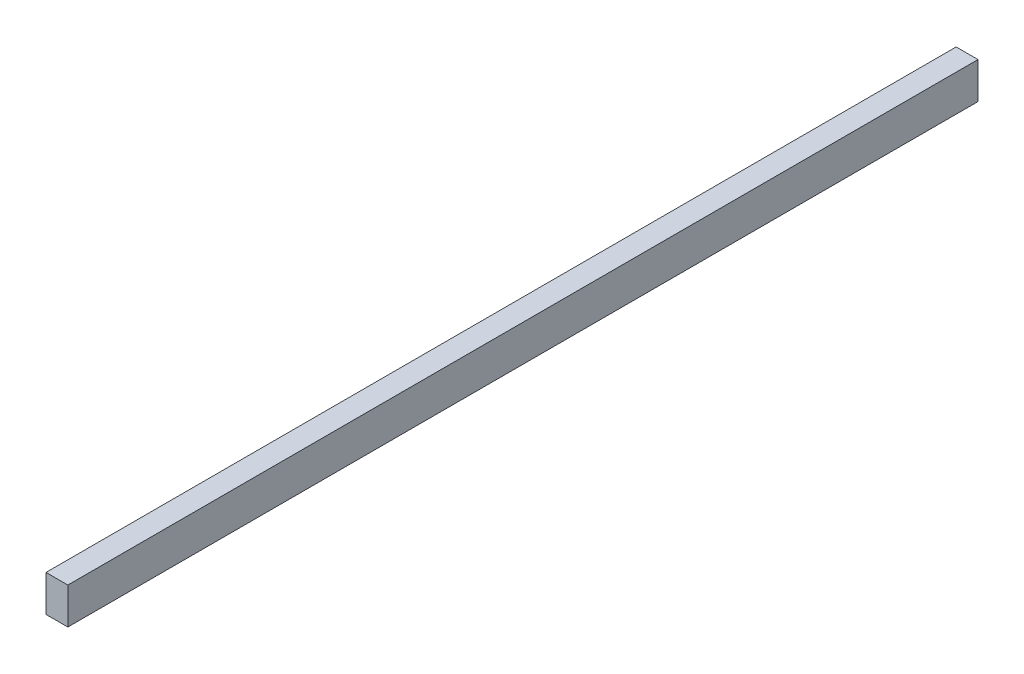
ISO-10303-21;
HEADER;
FILE_DESCRIPTION(('STEP AP214'),'2;1');
FILE_NAME('part.step','',(''),(''),'','','');
FILE_SCHEMA(('AUTOMOTIVE_DESIGN { 1 0 10303 214 1 1 1 1 }'));
ENDSEC;
DATA;
#1=APPLICATION_CONTEXT('core data for automotive mechanical design processes');
#2=APPLICATION_PROTOCOL_DEFINITION('international standard','automotive_design',2000,#1);
#3=PRODUCT_CONTEXT('',#1,'mechanical');
#4=PRODUCT('Part','Part','',(#3));
#5=PRODUCT_RELATED_PRODUCT_CATEGORY('part','',(#4));
#6=PRODUCT_DEFINITION_FORMATION('','',#4);
#7=PRODUCT_DEFINITION_CONTEXT('part definition',#1,'design');
#8=PRODUCT_DEFINITION('design','',#6,#7);
#9=PRODUCT_DEFINITION_SHAPE('','',#8);
#10=(LENGTH_UNIT() NAMED_UNIT(*) SI_UNIT(.MILLI.,.METRE.));
#11=(NAMED_UNIT(*) PLANE_ANGLE_UNIT() SI_UNIT($,.RADIAN.));
#12=(NAMED_UNIT(*) SI_UNIT($,.STERADIAN.) SOLID_ANGLE_UNIT());
#13=UNCERTAINTY_MEASURE_WITH_UNIT(LENGTH_MEASURE(1.E-05),#10,'distance_accuracy_value','');
#14=(GEOMETRIC_REPRESENTATION_CONTEXT(3) GLOBAL_UNCERTAINTY_ASSIGNED_CONTEXT((#13)) GLOBAL_UNIT_ASSIGNED_CONTEXT((#10,
#11,#12)) REPRESENTATION_CONTEXT('',''));
#15=CARTESIAN_POINT('',(0.,0.,0.));
#16=DIRECTION('',(0.,0.,1.));
#17=DIRECTION('',(1.,0.,0.));
#18=AXIS2_PLACEMENT_3D('',#15,#16,#17);
#19=CARTESIAN_POINT('',(0.,0.,625.));
#20=DIRECTION('',(1.,0.,0.));
#21=DIRECTION('',(0.,0.,-1.));
#22=AXIS2_PLACEMENT_3D('',#19,#20,#21);
#23=PLANE('',#22);
#24=DIRECTION('',(0.,-1.,0.));
#25=VECTOR('',#24,1.);
#26=CARTESIAN_POINT('',(0.,0.,0.));
#27=LINE('',#26,#25);
#28=CARTESIAN_POINT('',(0.,25.,0.));
#29=VERTEX_POINT('',#28);
#30=CARTESIAN_POINT('',(0.,0.,0.));
#31=VERTEX_POINT('',#30);
#32=EDGE_CURVE('E70',#29,#31,#27,.T.);
#33=ORIENTED_EDGE('',*,*,#32,.T.);
#34=DIRECTION('',(0.,0.,-1.));
#35=VECTOR('',#34,1.);
#36=CARTESIAN_POINT('',(0.,0.,625.));
#37=LINE('',#36,#35);
#38=CARTESIAN_POINT('',(0.,0.,625.));
#39=VERTEX_POINT('',#38);
#40=EDGE_CURVE('E11',#39,#31,#37,.T.);
#41=ORIENTED_EDGE('',*,*,#40,.F.);
#42=DIRECTION('',(0.,-1.,0.));
#43=VECTOR('',#42,1.);
#44=CARTESIAN_POINT('',(0.,0.,625.));
#45=LINE('',#44,#43);
#46=CARTESIAN_POINT('',(0.,25.,625.));
#47=VERTEX_POINT('',#46);
#48=EDGE_CURVE('E88',#47,#39,#45,.T.);
#49=ORIENTED_EDGE('',*,*,#48,.F.);
#50=DIRECTION('',(0.,0.,-1.));
#51=VECTOR('',#50,1.);
#52=CARTESIAN_POINT('',(0.,25.,625.));
#53=LINE('',#52,#51);
#54=EDGE_CURVE('E82',#47,#29,#53,.T.);
#55=ORIENTED_EDGE('',*,*,#54,.T.);
#56=EDGE_LOOP('',(#33,#41,#49,#55));
#57=FACE_BOUND('',#56,.T.);
#58=ADVANCED_FACE('F26',(#57),#23,.F.);
#59=CARTESIAN_POINT('',(0.,0.,625.));
#60=DIRECTION('',(0.,1.,0.));
#61=DIRECTION('',(0.,0.,1.));
#62=AXIS2_PLACEMENT_3D('',#59,#60,#61);
#63=PLANE('',#62);
#64=DIRECTION('',(1.,0.,0.));
#65=VECTOR('',#64,1.);
#66=CARTESIAN_POINT('',(0.,0.,0.));
#67=LINE('',#66,#65);
#68=CARTESIAN_POINT('',(15.,0.,0.));
#69=VERTEX_POINT('',#68);
#70=EDGE_CURVE('E66',#31,#69,#67,.T.);
#71=ORIENTED_EDGE('',*,*,#70,.T.);
#72=DIRECTION('',(0.,0.,-1.));
#73=VECTOR('',#72,1.);
#74=CARTESIAN_POINT('',(15.,0.,625.));
#75=LINE('',#74,#73);
#76=CARTESIAN_POINT('',(15.,0.,625.));
#77=VERTEX_POINT('',#76);
#78=EDGE_CURVE('E33',#77,#69,#75,.T.);
#79=ORIENTED_EDGE('',*,*,#78,.F.);
#80=DIRECTION('',(1.,0.,0.));
#81=VECTOR('',#80,1.);
#82=CARTESIAN_POINT('',(0.,0.,625.));
#83=LINE('',#82,#81);
#84=EDGE_CURVE('E78',#39,#77,#83,.T.);
#85=ORIENTED_EDGE('',*,*,#84,.F.);
#86=ORIENTED_EDGE('',*,*,#40,.T.);
#87=EDGE_LOOP('',(#71,#79,#85,#86));
#88=FACE_BOUND('',#87,.T.);
#89=ADVANCED_FACE('F77',(#88),#63,.F.);
#90=CARTESIAN_POINT('',(15.,0.,625.));
#91=DIRECTION('',(-1.,0.,0.));
#92=DIRECTION('',(0.,0.,1.));
#93=AXIS2_PLACEMENT_3D('',#90,#91,#92);
#94=PLANE('',#93);
#95=DIRECTION('',(0.,1.,0.));
#96=VECTOR('',#95,1.);
#97=CARTESIAN_POINT('',(15.,0.,0.));
#98=LINE('',#97,#96);
#99=CARTESIAN_POINT('',(15.,25.,0.));
#100=VERTEX_POINT('',#99);
#101=EDGE_CURVE('E71',#69,#100,#98,.T.);
#102=ORIENTED_EDGE('',*,*,#101,.T.);
#103=DIRECTION('',(0.,0.,-1.));
#104=VECTOR('',#103,1.);
#105=CARTESIAN_POINT('',(15.,25.,625.));
#106=LINE('',#105,#104);
#107=CARTESIAN_POINT('',(15.,25.,625.));
#108=VERTEX_POINT('',#107);
#109=EDGE_CURVE('E94',#108,#100,#106,.T.);
#110=ORIENTED_EDGE('',*,*,#109,.F.);
#111=DIRECTION('',(0.,1.,0.));
#112=VECTOR('',#111,1.);
#113=CARTESIAN_POINT('',(15.,0.,625.));
#114=LINE('',#113,#112);
#115=EDGE_CURVE('E45',#77,#108,#114,.T.);
#116=ORIENTED_EDGE('',*,*,#115,.F.);
#117=ORIENTED_EDGE('',*,*,#78,.T.);
#118=EDGE_LOOP('',(#102,#110,#116,#117));
#119=FACE_BOUND('',#118,.T.);
#120=ADVANCED_FACE('F97',(#119),#94,.F.);
#121=CARTESIAN_POINT('',(0.,25.,625.));
#122=DIRECTION('',(0.,-1.,0.));
#123=DIRECTION('',(0.,0.,-1.));
#124=AXIS2_PLACEMENT_3D('',#121,#122,#123);
#125=PLANE('',#124);
#126=DIRECTION('',(-1.,0.,0.));
#127=VECTOR('',#126,1.);
#128=CARTESIAN_POINT('',(0.,25.,0.));
#129=LINE('',#128,#127);
#130=EDGE_CURVE('E86',#100,#29,#129,.T.);
#131=ORIENTED_EDGE('',*,*,#130,.T.);
#132=ORIENTED_EDGE('',*,*,#54,.F.);
#133=DIRECTION('',(-1.,0.,0.));
#134=VECTOR('',#133,1.);
#135=CARTESIAN_POINT('',(0.,25.,625.));
#136=LINE('',#135,#134);
#137=EDGE_CURVE('E40',#108,#47,#136,.T.);
#138=ORIENTED_EDGE('',*,*,#137,.F.);
#139=ORIENTED_EDGE('',*,*,#109,.T.);
#140=EDGE_LOOP('',(#131,#132,#138,#139));
#141=FACE_BOUND('',#140,.T.);
#142=ADVANCED_FACE('F99',(#141),#125,.F.);
#143=CARTESIAN_POINT('',(0.,25.,625.));
#144=DIRECTION('',(0.,0.,-1.));
#145=DIRECTION('',(-1.,0.,0.));
#146=AXIS2_PLACEMENT_3D('',#143,#144,#145);
#147=PLANE('',#146);
#148=ORIENTED_EDGE('',*,*,#48,.T.);
#149=ORIENTED_EDGE('',*,*,#84,.T.);
#150=ORIENTED_EDGE('',*,*,#115,.T.);
#151=ORIENTED_EDGE('',*,*,#137,.T.);
#152=EDGE_LOOP('',(#148,#149,#150,#151));
#153=FACE_BOUND('',#152,.T.);
#154=ADVANCED_FACE('F100',(#153),#147,.F.);
#155=CARTESIAN_POINT('',(0.,25.,0.));
#156=DIRECTION('',(0.,0.,-1.));
#157=DIRECTION('',(-1.,0.,0.));
#158=AXIS2_PLACEMENT_3D('',#155,#156,#157);
#159=PLANE('',#158);
#160=ORIENTED_EDGE('',*,*,#32,.F.);
#161=ORIENTED_EDGE('',*,*,#130,.F.);
#162=ORIENTED_EDGE('',*,*,#101,.F.);
#163=ORIENTED_EDGE('',*,*,#70,.F.);
#164=EDGE_LOOP('',(#160,#161,#162,#163));
#165=FACE_BOUND('',#164,.T.);
#166=ADVANCED_FACE('F67',(#165),#159,.T.);
#167=CLOSED_SHELL('',(#58,#89,#120,#142,#154,#166));
#168=MANIFOLD_SOLID_BREP('B2',#167);
#169=ADVANCED_BREP_SHAPE_REPRESENTATION('',(#18,#168),#14);
#170=SHAPE_DEFINITION_REPRESENTATION(#9,#169);
ENDSEC;
END-ISO-10303-21;
